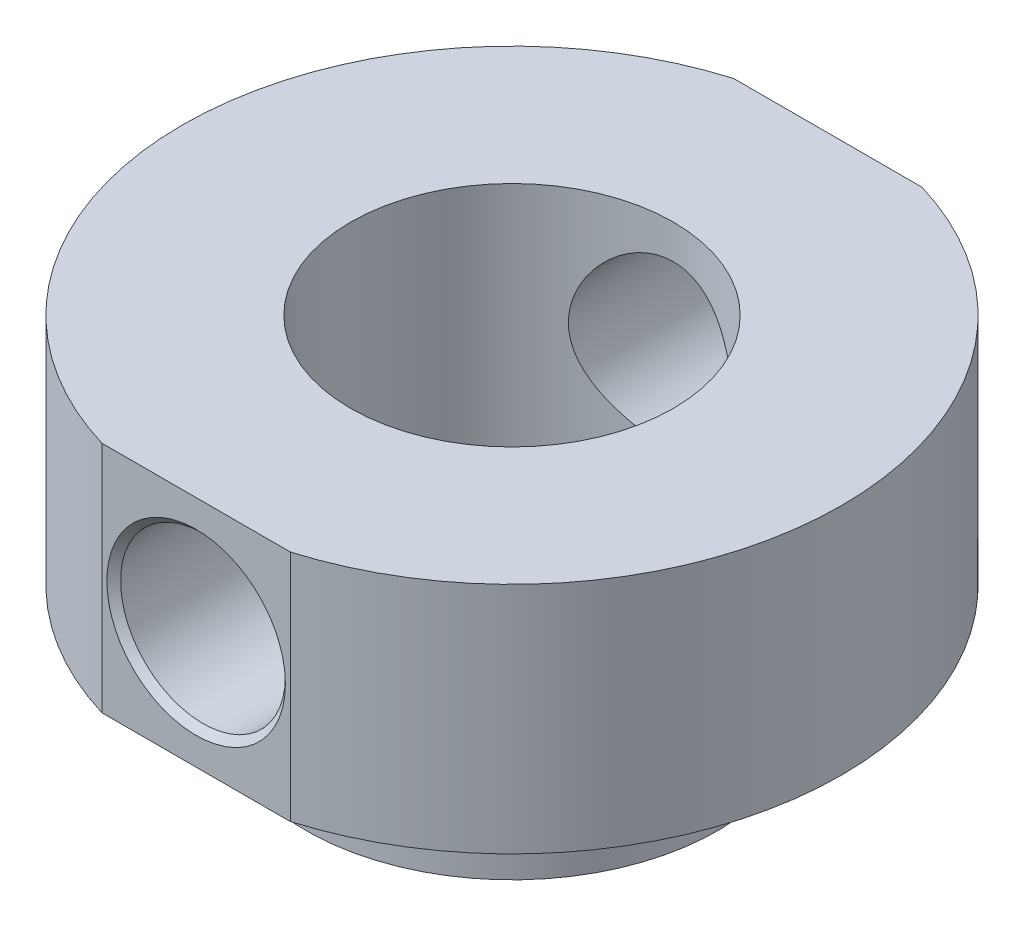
from build123d import *

# Parameters (mm, degrees)
ESQUISSE1_W                  = 12.25
ESQUISSE1_H                  = 17
ENL_V_MAT_EXTRU_1_DEPTH      = 38.960505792
ENL_V_MAT_EXTRU_1_DEPTH_BACK = 38.960505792
ESQUISSE3_R                  = 6
ESQUISSE4_OUTSIDE_W          = 63.996
ESQUISSE4_OUTSIDE_H          = 63.996
ESQUISSE4_OUTSIDE_W_2        = 55.38610506
ESQUISSE4_OUTSIDE_H_2        = 46
ENL_V_MAT_EXTRU_2_DEPTH      = 38.960505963
CHANFREIN2_SIZE              = 0.5
EXTRUSION1_START             = 8
ESQUISSE5_R                  = 15
ESQUISSE5_R_2                = 11.75
EXTRUSION1_DEPTH             = 8


with BuildPart() as part:
    # Esquisse1 → R_volution1 (revolve)
    with BuildSketch(Plane.XY, mode=Mode.PRIVATE) as r_volution1_sk:
        with Locations((17.875, 8.5)):
            Rectangle(ESQUISSE1_W, ESQUISSE1_H)
    revolve(r_volution1_sk.sketch.rotate(Axis((0, 0, 0), (0, 1, 0)), 90), axis=Axis((0, 0, 0), (0, 1, 0)))

    # Esquisse3 → Enl_v. mat.-Extru.1 (cut, two sides: drawn at the far end of the back side and taken through both)
    with BuildSketch(Plane.XY.offset(-ENL_V_MAT_EXTRU_1_DEPTH_BACK)):
        with Locations((0, 8.5)):
            Circle(ESQUISSE3_R)
    extrude(amount=ENL_V_MAT_EXTRU_1_DEPTH + ENL_V_MAT_EXTRU_1_DEPTH_BACK, mode=Mode.SUBTRACT)

    # Esquisse4 outside → Enl_v. mat.-Extru.2 (cut, through all)
    with BuildSketch(Plane(origin=(0, 17, 0), x_dir=(-1, 0, 0), z_dir=(0, 1, 0))):
        Rectangle(ESQUISSE4_OUTSIDE_W, ESQUISSE4_OUTSIDE_H)
        with Locations((2.246429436, 0)):
            Rectangle(ESQUISSE4_OUTSIDE_W_2, ESQUISSE4_OUTSIDE_H_2, mode=Mode.SUBTRACT)
    extrude(amount=-ENL_V_MAT_EXTRU_2_DEPTH, mode=Mode.SUBTRACT)

    # Chanfrein2
    chanfrein2_edges = [part.edges().sort_by_distance(p)[0] for p in [
        (-6, 8.5, 23),
        (-6, 8.5, -23),
    ]]
    chamfer(chanfrein2_edges, length=CHANFREIN2_SIZE)

    # Esquisse5 → Extrusion1 (add)
    with BuildSketch(Plane.XZ.offset(EXTRUSION1_START)):
        with Locations(Location((0, 0, 0), (0, 0, 270))):
            Circle(ESQUISSE5_R)
        with Locations(Location((0, 0, 0), (0, 0, 270))):
            Circle(ESQUISSE5_R_2, mode=Mode.SUBTRACT)
    extrude(amount=-EXTRUSION1_DEPTH)


solid = part.part
